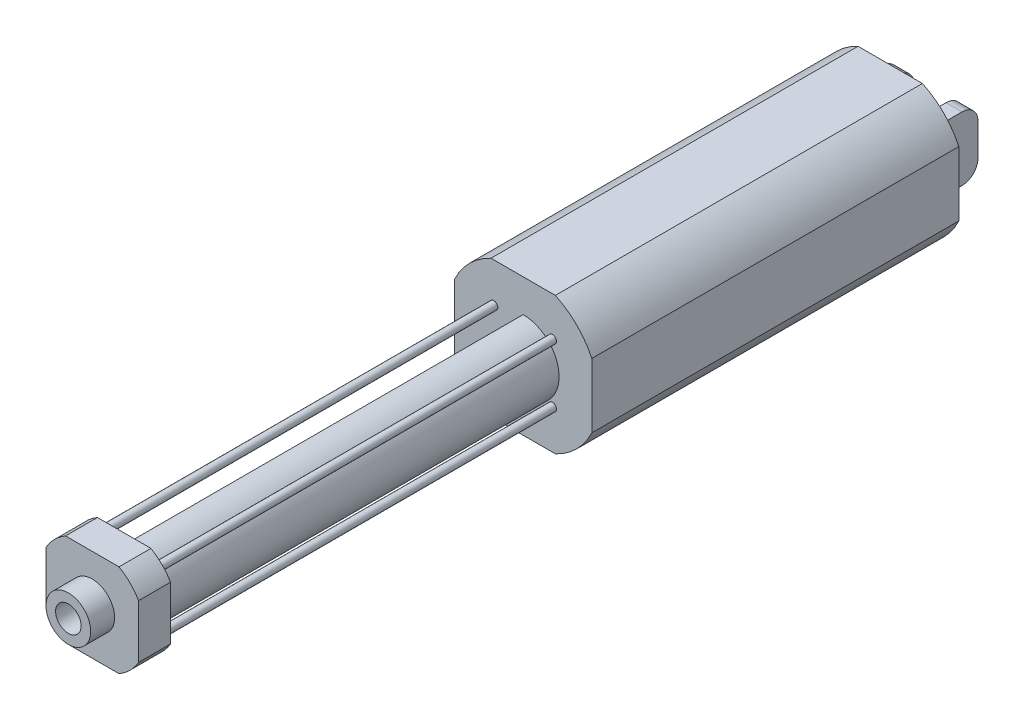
ISO-10303-21;
HEADER;
FILE_DESCRIPTION(('STEP AP214'),'2;1');
FILE_NAME('part.step','',(''),(''),'','','');
FILE_SCHEMA(('AUTOMOTIVE_DESIGN { 1 0 10303 214 1 1 1 1 }'));
ENDSEC;
DATA;
#1=APPLICATION_CONTEXT('core data for automotive mechanical design processes');
#2=APPLICATION_PROTOCOL_DEFINITION('international standard','automotive_design',2000,#1);
#3=PRODUCT_CONTEXT('',#1,'mechanical');
#4=PRODUCT('Part','Part','',(#3));
#5=PRODUCT_RELATED_PRODUCT_CATEGORY('part','',(#4));
#6=PRODUCT_DEFINITION_FORMATION('','',#4);
#7=PRODUCT_DEFINITION_CONTEXT('part definition',#1,'design');
#8=PRODUCT_DEFINITION('design','',#6,#7);
#9=PRODUCT_DEFINITION_SHAPE('','',#8);
#10=(LENGTH_UNIT() NAMED_UNIT(*) SI_UNIT(.MILLI.,.METRE.));
#11=(NAMED_UNIT(*) PLANE_ANGLE_UNIT() SI_UNIT($,.RADIAN.));
#12=(NAMED_UNIT(*) SI_UNIT($,.STERADIAN.) SOLID_ANGLE_UNIT());
#13=UNCERTAINTY_MEASURE_WITH_UNIT(LENGTH_MEASURE(1.E-05),#10,'distance_accuracy_value','');
#14=(GEOMETRIC_REPRESENTATION_CONTEXT(3) GLOBAL_UNCERTAINTY_ASSIGNED_CONTEXT((#13)) GLOBAL_UNIT_ASSIGNED_CONTEXT((#10,
#11,#12)) REPRESENTATION_CONTEXT('',''));
#15=CARTESIAN_POINT('',(0.,0.,0.));
#16=DIRECTION('',(0.,0.,1.));
#17=DIRECTION('',(1.,0.,0.));
#18=AXIS2_PLACEMENT_3D('',#15,#16,#17);
#19=CARTESIAN_POINT('',(43.,43.,500.));
#20=DIRECTION('',(0.,0.,1.));
#21=DIRECTION('',(1.,0.,0.));
#22=AXIS2_PLACEMENT_3D('',#19,#20,#21);
#23=PLANE('',#22);
#24=CARTESIAN_POINT('',(43.,43.,500.));
#25=DIRECTION('',(0.,0.,1.));
#26=DIRECTION('',(1.,0.,0.));
#27=AXIS2_PLACEMENT_3D('',#24,#25,#26);
#28=CIRCLE('',#27,33.5);
#29=CARTESIAN_POINT('',(59.7705098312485,14.,500.));
#30=VERTEX_POINT('',#29);
#31=CARTESIAN_POINT('',(72.,26.2294901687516,500.));
#32=VERTEX_POINT('',#31);
#33=EDGE_CURVE('E251',#30,#32,#28,.T.);
#34=ORIENTED_EDGE('',*,*,#33,.T.);
#35=DIRECTION('',(0.,1.,0.));
#36=VECTOR('',#35,1.);
#37=CARTESIAN_POINT('',(72.,26.2294901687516,500.));
#38=LINE('',#37,#36);
#39=CARTESIAN_POINT('',(72.,59.7705098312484,500.));
#40=VERTEX_POINT('',#39);
#41=EDGE_CURVE('E240',#32,#40,#38,.T.);
#42=ORIENTED_EDGE('',*,*,#41,.T.);
#43=CARTESIAN_POINT('',(43.,43.,500.));
#44=DIRECTION('',(0.,0.,1.));
#45=DIRECTION('',(1.,0.,0.));
#46=AXIS2_PLACEMENT_3D('',#43,#44,#45);
#47=CIRCLE('',#46,33.5);
#48=CARTESIAN_POINT('',(59.7705098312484,72.,500.));
#49=VERTEX_POINT('',#48);
#50=EDGE_CURVE('E250',#40,#49,#47,.T.);
#51=ORIENTED_EDGE('',*,*,#50,.T.);
#52=DIRECTION('',(-1.,0.,0.));
#53=VECTOR('',#52,1.);
#54=CARTESIAN_POINT('',(59.7705098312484,72.,500.));
#55=LINE('',#54,#53);
#56=CARTESIAN_POINT('',(26.2294901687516,72.,500.));
#57=VERTEX_POINT('',#56);
#58=EDGE_CURVE('E847',#49,#57,#55,.T.);
#59=ORIENTED_EDGE('',*,*,#58,.T.);
#60=CARTESIAN_POINT('',(43.,43.,500.));
#61=DIRECTION('',(0.,0.,1.));
#62=DIRECTION('',(1.,0.,0.));
#63=AXIS2_PLACEMENT_3D('',#60,#61,#62);
#64=CIRCLE('',#63,33.5);
#65=CARTESIAN_POINT('',(14.,59.7705098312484,500.));
#66=VERTEX_POINT('',#65);
#67=EDGE_CURVE('E849',#57,#66,#64,.T.);
#68=ORIENTED_EDGE('',*,*,#67,.T.);
#69=DIRECTION('',(0.,-1.,0.));
#70=VECTOR('',#69,1.);
#71=CARTESIAN_POINT('',(14.,59.7705098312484,500.));
#72=LINE('',#71,#70);
#73=CARTESIAN_POINT('',(14.,26.2294901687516,500.));
#74=VERTEX_POINT('',#73);
#75=EDGE_CURVE('E851',#66,#74,#72,.T.);
#76=ORIENTED_EDGE('',*,*,#75,.T.);
#77=CARTESIAN_POINT('',(43.,43.,500.));
#78=DIRECTION('',(0.,0.,1.));
#79=DIRECTION('',(1.,0.,0.));
#80=AXIS2_PLACEMENT_3D('',#77,#78,#79);
#81=CIRCLE('',#80,33.5);
#82=CARTESIAN_POINT('',(26.2294901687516,14.,500.));
#83=VERTEX_POINT('',#82);
#84=EDGE_CURVE('E853',#74,#83,#81,.T.);
#85=ORIENTED_EDGE('',*,*,#84,.T.);
#86=DIRECTION('',(1.,0.,0.));
#87=VECTOR('',#86,1.);
#88=CARTESIAN_POINT('',(26.2294901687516,14.,500.));
#89=LINE('',#88,#87);
#90=EDGE_CURVE('E256',#83,#30,#89,.T.);
#91=ORIENTED_EDGE('',*,*,#90,.T.);
#92=EDGE_LOOP('',(#34,#42,#51,#59,#68,#76,#85,#91));
#93=FACE_BOUND('',#92,.T.);
#94=CARTESIAN_POINT('',(43.,43.,500.));
#95=DIRECTION('',(0.,0.,1.));
#96=DIRECTION('',(1.,0.,0.));
#97=AXIS2_PLACEMENT_3D('',#94,#95,#96);
#98=CIRCLE('',#97,14.);
#99=CARTESIAN_POINT('',(57.,43.,500.));
#100=VERTEX_POINT('',#99);
#101=EDGE_CURVE('E826',#100,#100,#98,.T.);
#102=ORIENTED_EDGE('',*,*,#101,.F.);
#103=EDGE_LOOP('',(#102));
#104=FACE_BOUND('',#103,.T.);
#105=ADVANCED_FACE('F30',(#93,#104),#23,.T.);
#106=CARTESIAN_POINT('',(43.,43.,0.));
#107=DIRECTION('',(0.,0.,1.));
#108=DIRECTION('',(1.,0.,0.));
#109=AXIS2_PLACEMENT_3D('',#106,#107,#108);
#110=PLANE('',#109);
#111=DIRECTION('',(0.,-1.,0.));
#112=VECTOR('',#111,1.);
#113=CARTESIAN_POINT('',(68.,63.,0.));
#114=LINE('',#113,#112);
#115=CARTESIAN_POINT('',(68.,63.,0.));
#116=VERTEX_POINT('',#115);
#117=CARTESIAN_POINT('',(68.,23.,0.));
#118=VERTEX_POINT('',#117);
#119=EDGE_CURVE('E302',#116,#118,#114,.T.);
#120=ORIENTED_EDGE('',*,*,#119,.F.);
#121=DIRECTION('',(1.,0.,0.));
#122=VECTOR('',#121,1.);
#123=CARTESIAN_POINT('',(68.,63.,0.));
#124=LINE('',#123,#122);
#125=CARTESIAN_POINT('',(58.,63.,0.));
#126=VERTEX_POINT('',#125);
#127=EDGE_CURVE('E307',#126,#116,#124,.T.);
#128=ORIENTED_EDGE('',*,*,#127,.F.);
#129=DIRECTION('',(0.,1.,0.));
#130=VECTOR('',#129,1.);
#131=CARTESIAN_POINT('',(58.,63.,0.));
#132=LINE('',#131,#130);
#133=CARTESIAN_POINT('',(58.,23.,0.));
#134=VERTEX_POINT('',#133);
#135=EDGE_CURVE('E316',#134,#126,#132,.T.);
#136=ORIENTED_EDGE('',*,*,#135,.F.);
#137=DIRECTION('',(-1.,0.,0.));
#138=VECTOR('',#137,1.);
#139=CARTESIAN_POINT('',(68.,23.,0.));
#140=LINE('',#139,#138);
#141=EDGE_CURVE('E313',#118,#134,#140,.T.);
#142=ORIENTED_EDGE('',*,*,#141,.F.);
#143=EDGE_LOOP('',(#120,#128,#136,#142));
#144=FACE_BOUND('',#143,.T.);
#145=CARTESIAN_POINT('',(43.,43.,0.));
#146=DIRECTION('',(0.,0.,1.));
#147=DIRECTION('',(1.,0.,0.));
#148=AXIS2_PLACEMENT_3D('',#145,#146,#147);
#149=CIRCLE('',#148,47.5);
#150=CARTESIAN_POINT('',(22.8195639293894,86.,0.));
#151=VERTEX_POINT('',#150);
#152=CARTESIAN_POINT('',(0.,63.1804360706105,0.));
#153=VERTEX_POINT('',#152);
#154=EDGE_CURVE('E360',#151,#153,#149,.T.);
#155=ORIENTED_EDGE('',*,*,#154,.F.);
#156=DIRECTION('',(-1.,0.,0.));
#157=VECTOR('',#156,1.);
#158=CARTESIAN_POINT('',(22.8195639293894,86.,0.));
#159=LINE('',#158,#157);
#160=CARTESIAN_POINT('',(63.1804360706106,86.,0.));
#161=VERTEX_POINT('',#160);
#162=EDGE_CURVE('E365',#161,#151,#159,.T.);
#163=ORIENTED_EDGE('',*,*,#162,.F.);
#164=CARTESIAN_POINT('',(43.,43.,0.));
#165=DIRECTION('',(0.,0.,1.));
#166=DIRECTION('',(1.,0.,0.));
#167=AXIS2_PLACEMENT_3D('',#164,#165,#166);
#168=CIRCLE('',#167,47.5);
#169=CARTESIAN_POINT('',(86.,63.1804360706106,0.));
#170=VERTEX_POINT('',#169);
#171=EDGE_CURVE('E392',#170,#161,#168,.T.);
#172=ORIENTED_EDGE('',*,*,#171,.F.);
#173=DIRECTION('',(0.,1.,0.));
#174=VECTOR('',#173,1.);
#175=CARTESIAN_POINT('',(86.,63.1804360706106,0.));
#176=LINE('',#175,#174);
#177=CARTESIAN_POINT('',(86.,22.8195639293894,0.));
#178=VERTEX_POINT('',#177);
#179=EDGE_CURVE('E390',#178,#170,#176,.T.);
#180=ORIENTED_EDGE('',*,*,#179,.F.);
#181=CARTESIAN_POINT('',(43.,43.,0.));
#182=DIRECTION('',(0.,0.,1.));
#183=DIRECTION('',(1.,0.,0.));
#184=AXIS2_PLACEMENT_3D('',#181,#182,#183);
#185=CIRCLE('',#184,47.5);
#186=CARTESIAN_POINT('',(63.1804360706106,0.,0.));
#187=VERTEX_POINT('',#186);
#188=EDGE_CURVE('E388',#187,#178,#185,.T.);
#189=ORIENTED_EDGE('',*,*,#188,.F.);
#190=DIRECTION('',(1.,0.,0.));
#191=VECTOR('',#190,1.);
#192=CARTESIAN_POINT('',(22.8195639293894,0.,0.));
#193=LINE('',#192,#191);
#194=CARTESIAN_POINT('',(22.8195639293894,0.,0.));
#195=VERTEX_POINT('',#194);
#196=EDGE_CURVE('E386',#195,#187,#193,.T.);
#197=ORIENTED_EDGE('',*,*,#196,.F.);
#198=CARTESIAN_POINT('',(43.,43.,0.));
#199=DIRECTION('',(0.,0.,1.));
#200=DIRECTION('',(1.,0.,0.));
#201=AXIS2_PLACEMENT_3D('',#198,#199,#200);
#202=CIRCLE('',#201,47.5);
#203=CARTESIAN_POINT('',(0.,22.8195639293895,0.));
#204=VERTEX_POINT('',#203);
#205=EDGE_CURVE('E384',#204,#195,#202,.T.);
#206=ORIENTED_EDGE('',*,*,#205,.F.);
#207=DIRECTION('',(0.,-1.,0.));
#208=VECTOR('',#207,1.);
#209=CARTESIAN_POINT('',(0.,63.1804360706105,0.));
#210=LINE('',#209,#208);
#211=EDGE_CURVE('E382',#153,#204,#210,.T.);
#212=ORIENTED_EDGE('',*,*,#211,.F.);
#213=EDGE_LOOP('',(#155,#163,#172,#180,#189,#197,#206,#212));
#214=FACE_BOUND('',#213,.T.);
#215=DIRECTION('',(1.,0.,0.));
#216=VECTOR('',#215,1.);
#217=CARTESIAN_POINT('',(18.,63.,0.));
#218=LINE('',#217,#216);
#219=CARTESIAN_POINT('',(18.,63.,0.));
#220=VERTEX_POINT('',#219);
#221=CARTESIAN_POINT('',(28.,63.,0.));
#222=VERTEX_POINT('',#221);
#223=EDGE_CURVE('E276',#220,#222,#218,.T.);
#224=ORIENTED_EDGE('',*,*,#223,.F.);
#225=DIRECTION('',(0.,1.,0.));
#226=VECTOR('',#225,1.);
#227=CARTESIAN_POINT('',(18.,63.,0.));
#228=LINE('',#227,#226);
#229=CARTESIAN_POINT('',(18.,23.,0.));
#230=VERTEX_POINT('',#229);
#231=EDGE_CURVE('E281',#230,#220,#228,.T.);
#232=ORIENTED_EDGE('',*,*,#231,.F.);
#233=DIRECTION('',(-1.,0.,0.));
#234=VECTOR('',#233,1.);
#235=CARTESIAN_POINT('',(18.,23.,0.));
#236=LINE('',#235,#234);
#237=CARTESIAN_POINT('',(28.,23.,0.));
#238=VERTEX_POINT('',#237);
#239=EDGE_CURVE('E290',#238,#230,#236,.T.);
#240=ORIENTED_EDGE('',*,*,#239,.F.);
#241=DIRECTION('',(0.,-1.,0.));
#242=VECTOR('',#241,1.);
#243=CARTESIAN_POINT('',(28.,63.,0.));
#244=LINE('',#243,#242);
#245=EDGE_CURVE('E287',#222,#238,#244,.T.);
#246=ORIENTED_EDGE('',*,*,#245,.F.);
#247=EDGE_LOOP('',(#224,#232,#240,#246));
#248=FACE_BOUND('',#247,.T.);
#249=ADVANCED_FACE('F467',(#144,#214,#248),#110,.F.);
#250=CARTESIAN_POINT('',(43.,43.,230.));
#251=DIRECTION('',(0.,0.,1.));
#252=DIRECTION('',(1.,0.,0.));
#253=AXIS2_PLACEMENT_3D('',#250,#251,#252);
#254=PLANE('',#253);
#255=CARTESIAN_POINT('',(24.6152236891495,24.61522368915,230.));
#256=DIRECTION('',(0.,0.,1.));
#257=DIRECTION('',(1.,0.,0.));
#258=AXIS2_PLACEMENT_3D('',#255,#256,#257);
#259=CIRCLE('',#258,2.5);
#260=CARTESIAN_POINT('',(27.1152236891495,24.61522368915,230.));
#261=VERTEX_POINT('',#260);
#262=EDGE_CURVE('E11',#261,#261,#259,.T.);
#263=ORIENTED_EDGE('',*,*,#262,.F.);
#264=EDGE_LOOP('',(#263));
#265=FACE_BOUND('',#264,.T.);
#266=CARTESIAN_POINT('',(61.3847763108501,24.6152236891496,230.));
#267=DIRECTION('',(0.,0.,1.));
#268=DIRECTION('',(1.,0.,0.));
#269=AXIS2_PLACEMENT_3D('',#266,#267,#268);
#270=CIRCLE('',#269,2.5);
#271=CARTESIAN_POINT('',(63.8847763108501,24.6152236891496,230.));
#272=VERTEX_POINT('',#271);
#273=EDGE_CURVE('E38',#272,#272,#270,.T.);
#274=ORIENTED_EDGE('',*,*,#273,.F.);
#275=EDGE_LOOP('',(#274));
#276=FACE_BOUND('',#275,.T.);
#277=CARTESIAN_POINT('',(61.3847763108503,61.3847763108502,230.));
#278=DIRECTION('',(0.,0.,1.));
#279=DIRECTION('',(1.,0.,0.));
#280=AXIS2_PLACEMENT_3D('',#277,#278,#279);
#281=CIRCLE('',#280,2.5);
#282=CARTESIAN_POINT('',(63.8847763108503,61.3847763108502,230.));
#283=VERTEX_POINT('',#282);
#284=EDGE_CURVE('E455',#283,#283,#281,.T.);
#285=ORIENTED_EDGE('',*,*,#284,.F.);
#286=EDGE_LOOP('',(#285));
#287=FACE_BOUND('',#286,.T.);
#288=CARTESIAN_POINT('',(24.6152236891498,61.3847763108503,230.));
#289=DIRECTION('',(0.,0.,1.));
#290=DIRECTION('',(1.,0.,0.));
#291=AXIS2_PLACEMENT_3D('',#288,#289,#290);
#292=CIRCLE('',#291,2.5);
#293=CARTESIAN_POINT('',(27.1152236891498,61.3847763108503,230.));
#294=VERTEX_POINT('',#293);
#295=EDGE_CURVE('E452',#294,#294,#292,.T.);
#296=ORIENTED_EDGE('',*,*,#295,.F.);
#297=EDGE_LOOP('',(#296));
#298=FACE_BOUND('',#297,.T.);
#299=CARTESIAN_POINT('',(43.,43.,230.));
#300=DIRECTION('',(0.,0.,1.));
#301=DIRECTION('',(1.,0.,0.));
#302=AXIS2_PLACEMENT_3D('',#299,#300,#301);
#303=CIRCLE('',#302,47.5);
#304=CARTESIAN_POINT('',(22.8195639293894,86.,230.));
#305=VERTEX_POINT('',#304);
#306=CARTESIAN_POINT('',(0.,63.1804360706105,230.));
#307=VERTEX_POINT('',#306);
#308=EDGE_CURVE('E361',#305,#307,#303,.T.);
#309=ORIENTED_EDGE('',*,*,#308,.T.);
#310=DIRECTION('',(0.,-1.,0.));
#311=VECTOR('',#310,1.);
#312=CARTESIAN_POINT('',(0.,63.1804360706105,230.));
#313=LINE('',#312,#311);
#314=CARTESIAN_POINT('',(0.,22.8195639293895,230.));
#315=VERTEX_POINT('',#314);
#316=EDGE_CURVE('E364',#307,#315,#313,.T.);
#317=ORIENTED_EDGE('',*,*,#316,.T.);
#318=CARTESIAN_POINT('',(43.,43.,230.));
#319=DIRECTION('',(0.,0.,1.));
#320=DIRECTION('',(1.,0.,0.));
#321=AXIS2_PLACEMENT_3D('',#318,#319,#320);
#322=CIRCLE('',#321,47.5);
#323=CARTESIAN_POINT('',(22.8195639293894,0.,230.));
#324=VERTEX_POINT('',#323);
#325=EDGE_CURVE('E367',#315,#324,#322,.T.);
#326=ORIENTED_EDGE('',*,*,#325,.T.);
#327=DIRECTION('',(1.,0.,0.));
#328=VECTOR('',#327,1.);
#329=CARTESIAN_POINT('',(22.8195639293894,0.,230.));
#330=LINE('',#329,#328);
#331=CARTESIAN_POINT('',(63.1804360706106,0.,230.));
#332=VERTEX_POINT('',#331);
#333=EDGE_CURVE('E369',#324,#332,#330,.T.);
#334=ORIENTED_EDGE('',*,*,#333,.T.);
#335=CARTESIAN_POINT('',(43.,43.,230.));
#336=DIRECTION('',(0.,0.,1.));
#337=DIRECTION('',(1.,0.,0.));
#338=AXIS2_PLACEMENT_3D('',#335,#336,#337);
#339=CIRCLE('',#338,47.5);
#340=CARTESIAN_POINT('',(86.,22.8195639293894,230.));
#341=VERTEX_POINT('',#340);
#342=EDGE_CURVE('E371',#332,#341,#339,.T.);
#343=ORIENTED_EDGE('',*,*,#342,.T.);
#344=DIRECTION('',(0.,1.,0.));
#345=VECTOR('',#344,1.);
#346=CARTESIAN_POINT('',(86.,63.1804360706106,230.));
#347=LINE('',#346,#345);
#348=CARTESIAN_POINT('',(86.,63.1804360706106,230.));
#349=VERTEX_POINT('',#348);
#350=EDGE_CURVE('E373',#341,#349,#347,.T.);
#351=ORIENTED_EDGE('',*,*,#350,.T.);
#352=CARTESIAN_POINT('',(43.,43.,230.));
#353=DIRECTION('',(0.,0.,1.));
#354=DIRECTION('',(1.,0.,0.));
#355=AXIS2_PLACEMENT_3D('',#352,#353,#354);
#356=CIRCLE('',#355,47.5);
#357=CARTESIAN_POINT('',(63.1804360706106,86.,230.));
#358=VERTEX_POINT('',#357);
#359=EDGE_CURVE('E375',#349,#358,#356,.T.);
#360=ORIENTED_EDGE('',*,*,#359,.T.);
#361=DIRECTION('',(-1.,0.,0.));
#362=VECTOR('',#361,1.);
#363=CARTESIAN_POINT('',(22.8195639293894,86.,230.));
#364=LINE('',#363,#362);
#365=EDGE_CURVE('E377',#358,#305,#364,.T.);
#366=ORIENTED_EDGE('',*,*,#365,.T.);
#367=EDGE_LOOP('',(#309,#317,#326,#334,#343,#351,#360,#366));
#368=FACE_BOUND('',#367,.T.);
#369=DIRECTION('',(0.,-1.,0.));
#370=VECTOR('',#369,1.);
#371=CARTESIAN_POINT('',(43.,65.5,230.));
#372=LINE('',#371,#370);
#373=CARTESIAN_POINT('',(43.,65.5,230.));
#374=VERTEX_POINT('',#373);
#375=CARTESIAN_POINT('',(43.,63.,230.));
#376=VERTEX_POINT('',#375);
#377=EDGE_CURVE('E345',#374,#376,#372,.T.);
#378=ORIENTED_EDGE('',*,*,#377,.F.);
#379=CARTESIAN_POINT('',(43.,43.,230.));
#380=DIRECTION('',(0.,0.,1.));
#381=DIRECTION('',(1.,0.,0.));
#382=AXIS2_PLACEMENT_3D('',#379,#380,#381);
#383=CIRCLE('',#382,22.5);
#384=CARTESIAN_POINT('',(20.5,43.,230.));
#385=VERTEX_POINT('',#384);
#386=EDGE_CURVE('E328',#385,#374,#383,.T.);
#387=ORIENTED_EDGE('',*,*,#386,.F.);
#388=DIRECTION('',(-1.,0.,0.));
#389=VECTOR('',#388,1.);
#390=CARTESIAN_POINT('',(20.5,43.,230.));
#391=LINE('',#390,#389);
#392=CARTESIAN_POINT('',(23.,43.,230.));
#393=VERTEX_POINT('',#392);
#394=EDGE_CURVE('E333',#393,#385,#391,.T.);
#395=ORIENTED_EDGE('',*,*,#394,.F.);
#396=CARTESIAN_POINT('',(43.,43.,230.));
#397=DIRECTION('',(0.,0.,-1.));
#398=DIRECTION('',(1.,0.,0.));
#399=AXIS2_PLACEMENT_3D('',#396,#397,#398);
#400=CIRCLE('',#399,20.);
#401=EDGE_CURVE('E347',#376,#393,#400,.T.);
#402=ORIENTED_EDGE('',*,*,#401,.F.);
#403=EDGE_LOOP('',(#378,#387,#395,#402));
#404=FACE_BOUND('',#403,.T.);
#405=ADVANCED_FACE('F463',(#265,#276,#287,#298,#368,#404),#254,.T.);
#406=CARTESIAN_POINT('',(43.,43.,230.));
#407=DIRECTION('',(0.,0.,-1.));
#408=DIRECTION('',(-1.,0.,0.));
#409=AXIS2_PLACEMENT_3D('',#406,#407,#408);
#410=CYLINDRICAL_SURFACE('',#409,47.5);
#411=ORIENTED_EDGE('',*,*,#154,.T.);
#412=DIRECTION('',(0.,0.,-1.));
#413=VECTOR('',#412,1.);
#414=CARTESIAN_POINT('',(0.,63.1804360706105,230.));
#415=LINE('',#414,#413);
#416=EDGE_CURVE('E415',#307,#153,#415,.T.);
#417=ORIENTED_EDGE('',*,*,#416,.F.);
#418=ORIENTED_EDGE('',*,*,#308,.F.);
#419=DIRECTION('',(0.,0.,-1.));
#420=VECTOR('',#419,1.);
#421=CARTESIAN_POINT('',(22.8195639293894,86.,230.));
#422=LINE('',#421,#420);
#423=EDGE_CURVE('E379',#305,#151,#422,.T.);
#424=ORIENTED_EDGE('',*,*,#423,.T.);
#425=EDGE_LOOP('',(#411,#417,#418,#424));
#426=FACE_BOUND('',#425,.T.);
#427=ADVANCED_FACE('F466',(#426),#410,.T.);
#428=CARTESIAN_POINT('',(0.,63.1804360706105,230.));
#429=DIRECTION('',(1.,0.,0.));
#430=DIRECTION('',(0.,0.,-1.));
#431=AXIS2_PLACEMENT_3D('',#428,#429,#430);
#432=PLANE('',#431);
#433=ORIENTED_EDGE('',*,*,#211,.T.);
#434=DIRECTION('',(0.,0.,-1.));
#435=VECTOR('',#434,1.);
#436=CARTESIAN_POINT('',(0.,22.8195639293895,230.));
#437=LINE('',#436,#435);
#438=EDGE_CURVE('E412',#315,#204,#437,.T.);
#439=ORIENTED_EDGE('',*,*,#438,.F.);
#440=ORIENTED_EDGE('',*,*,#316,.F.);
#441=ORIENTED_EDGE('',*,*,#416,.T.);
#442=EDGE_LOOP('',(#433,#439,#440,#441));
#443=FACE_BOUND('',#442,.T.);
#444=ADVANCED_FACE('F637',(#443),#432,.F.);
#445=CARTESIAN_POINT('',(43.,43.,230.));
#446=DIRECTION('',(0.,0.,-1.));
#447=DIRECTION('',(-1.,0.,0.));
#448=AXIS2_PLACEMENT_3D('',#445,#446,#447);
#449=CYLINDRICAL_SURFACE('',#448,47.5);
#450=ORIENTED_EDGE('',*,*,#205,.T.);
#451=DIRECTION('',(0.,0.,-1.));
#452=VECTOR('',#451,1.);
#453=CARTESIAN_POINT('',(22.8195639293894,0.,230.));
#454=LINE('',#453,#452);
#455=EDGE_CURVE('E409',#324,#195,#454,.T.);
#456=ORIENTED_EDGE('',*,*,#455,.F.);
#457=ORIENTED_EDGE('',*,*,#325,.F.);
#458=ORIENTED_EDGE('',*,*,#438,.T.);
#459=EDGE_LOOP('',(#450,#456,#457,#458));
#460=FACE_BOUND('',#459,.T.);
#461=ADVANCED_FACE('F641',(#460),#449,.T.);
#462=CARTESIAN_POINT('',(22.8195639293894,0.,230.));
#463=DIRECTION('',(0.,1.,0.));
#464=DIRECTION('',(0.,0.,1.));
#465=AXIS2_PLACEMENT_3D('',#462,#463,#464);
#466=PLANE('',#465);
#467=ORIENTED_EDGE('',*,*,#196,.T.);
#468=DIRECTION('',(0.,0.,-1.));
#469=VECTOR('',#468,1.);
#470=CARTESIAN_POINT('',(63.1804360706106,0.,230.));
#471=LINE('',#470,#469);
#472=EDGE_CURVE('E406',#332,#187,#471,.T.);
#473=ORIENTED_EDGE('',*,*,#472,.F.);
#474=ORIENTED_EDGE('',*,*,#333,.F.);
#475=ORIENTED_EDGE('',*,*,#455,.T.);
#476=EDGE_LOOP('',(#467,#473,#474,#475));
#477=FACE_BOUND('',#476,.T.);
#478=ADVANCED_FACE('F645',(#477),#466,.F.);
#479=CARTESIAN_POINT('',(43.,43.,230.));
#480=DIRECTION('',(0.,0.,-1.));
#481=DIRECTION('',(-1.,0.,0.));
#482=AXIS2_PLACEMENT_3D('',#479,#480,#481);
#483=CYLINDRICAL_SURFACE('',#482,47.5);
#484=ORIENTED_EDGE('',*,*,#188,.T.);
#485=DIRECTION('',(0.,0.,-1.));
#486=VECTOR('',#485,1.);
#487=CARTESIAN_POINT('',(86.,22.8195639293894,230.));
#488=LINE('',#487,#486);
#489=EDGE_CURVE('E403',#341,#178,#488,.T.);
#490=ORIENTED_EDGE('',*,*,#489,.F.);
#491=ORIENTED_EDGE('',*,*,#342,.F.);
#492=ORIENTED_EDGE('',*,*,#472,.T.);
#493=EDGE_LOOP('',(#484,#490,#491,#492));
#494=FACE_BOUND('',#493,.T.);
#495=ADVANCED_FACE('F649',(#494),#483,.T.);
#496=CARTESIAN_POINT('',(86.,63.1804360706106,230.));
#497=DIRECTION('',(-1.,0.,0.));
#498=DIRECTION('',(0.,-1.,0.));
#499=AXIS2_PLACEMENT_3D('',#496,#497,#498);
#500=PLANE('',#499);
#501=ORIENTED_EDGE('',*,*,#179,.T.);
#502=DIRECTION('',(0.,0.,-1.));
#503=VECTOR('',#502,1.);
#504=CARTESIAN_POINT('',(86.,63.1804360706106,230.));
#505=LINE('',#504,#503);
#506=EDGE_CURVE('E400',#349,#170,#505,.T.);
#507=ORIENTED_EDGE('',*,*,#506,.F.);
#508=ORIENTED_EDGE('',*,*,#350,.F.);
#509=ORIENTED_EDGE('',*,*,#489,.T.);
#510=EDGE_LOOP('',(#501,#507,#508,#509));
#511=FACE_BOUND('',#510,.T.);
#512=ADVANCED_FACE('F653',(#511),#500,.F.);
#513=CARTESIAN_POINT('',(43.,43.,230.));
#514=DIRECTION('',(0.,0.,-1.));
#515=DIRECTION('',(-1.,0.,0.));
#516=AXIS2_PLACEMENT_3D('',#513,#514,#515);
#517=CYLINDRICAL_SURFACE('',#516,47.5);
#518=ORIENTED_EDGE('',*,*,#171,.T.);
#519=DIRECTION('',(0.,0.,-1.));
#520=VECTOR('',#519,1.);
#521=CARTESIAN_POINT('',(63.1804360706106,86.,230.));
#522=LINE('',#521,#520);
#523=EDGE_CURVE('E397',#358,#161,#522,.T.);
#524=ORIENTED_EDGE('',*,*,#523,.F.);
#525=ORIENTED_EDGE('',*,*,#359,.F.);
#526=ORIENTED_EDGE('',*,*,#506,.T.);
#527=EDGE_LOOP('',(#518,#524,#525,#526));
#528=FACE_BOUND('',#527,.T.);
#529=ADVANCED_FACE('F657',(#528),#517,.T.);
#530=CARTESIAN_POINT('',(22.8195639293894,86.,230.));
#531=DIRECTION('',(0.,-1.,0.));
#532=DIRECTION('',(0.,0.,-1.));
#533=AXIS2_PLACEMENT_3D('',#530,#531,#532);
#534=PLANE('',#533);
#535=ORIENTED_EDGE('',*,*,#162,.T.);
#536=ORIENTED_EDGE('',*,*,#423,.F.);
#537=ORIENTED_EDGE('',*,*,#365,.F.);
#538=ORIENTED_EDGE('',*,*,#523,.T.);
#539=EDGE_LOOP('',(#535,#536,#537,#538));
#540=FACE_BOUND('',#539,.T.);
#541=ADVANCED_FACE('F661',(#540),#534,.F.);
#542=CARTESIAN_POINT('',(43.,43.,480.));
#543=DIRECTION('',(0.,0.,-1.));
#544=DIRECTION('',(-1.,0.,0.));
#545=AXIS2_PLACEMENT_3D('',#542,#543,#544);
#546=CYLINDRICAL_SURFACE('',#545,22.5);
#547=ORIENTED_EDGE('',*,*,#386,.T.);
#548=DIRECTION('',(0.,0.,-1.));
#549=VECTOR('',#548,1.);
#550=CARTESIAN_POINT('',(43.,65.5,480.));
#551=LINE('',#550,#549);
#552=CARTESIAN_POINT('',(43.,65.5,480.));
#553=VERTEX_POINT('',#552);
#554=EDGE_CURVE('E358',#553,#374,#551,.T.);
#555=ORIENTED_EDGE('',*,*,#554,.F.);
#556=CARTESIAN_POINT('',(43.,43.,480.));
#557=DIRECTION('',(0.,0.,1.));
#558=DIRECTION('',(1.,0.,0.));
#559=AXIS2_PLACEMENT_3D('',#556,#557,#558);
#560=CIRCLE('',#559,22.5);
#561=CARTESIAN_POINT('',(20.5,43.,480.));
#562=VERTEX_POINT('',#561);
#563=EDGE_CURVE('E329',#562,#553,#560,.T.);
#564=ORIENTED_EDGE('',*,*,#563,.F.);
#565=DIRECTION('',(0.,0.,-1.));
#566=VECTOR('',#565,1.);
#567=CARTESIAN_POINT('',(20.5,43.,480.));
#568=LINE('',#567,#566);
#569=EDGE_CURVE('E342',#562,#385,#568,.T.);
#570=ORIENTED_EDGE('',*,*,#569,.T.);
#571=EDGE_LOOP('',(#547,#555,#564,#570));
#572=FACE_BOUND('',#571,.T.);
#573=ADVANCED_FACE('F491',(#572),#546,.T.);
#574=CARTESIAN_POINT('',(43.,65.5,480.));
#575=DIRECTION('',(1.,0.,0.));
#576=DIRECTION('',(0.,0.,-1.));
#577=AXIS2_PLACEMENT_3D('',#574,#575,#576);
#578=PLANE('',#577);
#579=ORIENTED_EDGE('',*,*,#377,.T.);
#580=DIRECTION('',(0.,0.,-1.));
#581=VECTOR('',#580,1.);
#582=CARTESIAN_POINT('',(43.,63.,480.));
#583=LINE('',#582,#581);
#584=CARTESIAN_POINT('',(43.,63.,480.));
#585=VERTEX_POINT('',#584);
#586=EDGE_CURVE('E355',#585,#376,#583,.T.);
#587=ORIENTED_EDGE('',*,*,#586,.F.);
#588=DIRECTION('',(0.,-1.,0.));
#589=VECTOR('',#588,1.);
#590=CARTESIAN_POINT('',(43.,65.5,480.));
#591=LINE('',#590,#589);
#592=EDGE_CURVE('E332',#553,#585,#591,.T.);
#593=ORIENTED_EDGE('',*,*,#592,.F.);
#594=ORIENTED_EDGE('',*,*,#554,.T.);
#595=EDGE_LOOP('',(#579,#587,#593,#594));
#596=FACE_BOUND('',#595,.T.);
#597=ADVANCED_FACE('F482',(#596),#578,.F.);
#598=CARTESIAN_POINT('',(43.,43.,480.));
#599=DIRECTION('',(0.,0.,-1.));
#600=DIRECTION('',(-1.,0.,0.));
#601=AXIS2_PLACEMENT_3D('',#598,#599,#600);
#602=CYLINDRICAL_SURFACE('',#601,20.);
#603=ORIENTED_EDGE('',*,*,#401,.T.);
#604=DIRECTION('',(0.,0.,-1.));
#605=VECTOR('',#604,1.);
#606=CARTESIAN_POINT('',(23.,43.,480.));
#607=LINE('',#606,#605);
#608=CARTESIAN_POINT('',(23.,43.,480.));
#609=VERTEX_POINT('',#608);
#610=EDGE_CURVE('E353',#609,#393,#607,.T.);
#611=ORIENTED_EDGE('',*,*,#610,.F.);
#612=CARTESIAN_POINT('',(43.,43.,480.));
#613=DIRECTION('',(0.,0.,-1.));
#614=DIRECTION('',(1.,0.,0.));
#615=AXIS2_PLACEMENT_3D('',#612,#613,#614);
#616=CIRCLE('',#615,20.);
#617=EDGE_CURVE('E336',#585,#609,#616,.T.);
#618=ORIENTED_EDGE('',*,*,#617,.F.);
#619=ORIENTED_EDGE('',*,*,#586,.T.);
#620=EDGE_LOOP('',(#603,#611,#618,#619));
#621=FACE_BOUND('',#620,.T.);
#622=ADVANCED_FACE('F486',(#621),#602,.F.);
#623=CARTESIAN_POINT('',(20.5,43.,480.));
#624=DIRECTION('',(0.,-1.,0.));
#625=DIRECTION('',(0.,0.,-1.));
#626=AXIS2_PLACEMENT_3D('',#623,#624,#625);
#627=PLANE('',#626);
#628=ORIENTED_EDGE('',*,*,#394,.T.);
#629=ORIENTED_EDGE('',*,*,#569,.F.);
#630=DIRECTION('',(-1.,0.,0.));
#631=VECTOR('',#630,1.);
#632=CARTESIAN_POINT('',(20.5,43.,480.));
#633=LINE('',#632,#631);
#634=EDGE_CURVE('E339',#609,#562,#633,.T.);
#635=ORIENTED_EDGE('',*,*,#634,.F.);
#636=ORIENTED_EDGE('',*,*,#610,.T.);
#637=EDGE_LOOP('',(#628,#629,#635,#636));
#638=FACE_BOUND('',#637,.T.);
#639=ADVANCED_FACE('F494',(#638),#627,.F.);
#640=CARTESIAN_POINT('',(68.,63.,-30.));
#641=DIRECTION('',(-1.,0.,0.));
#642=DIRECTION('',(0.,-1.,0.));
#643=AXIS2_PLACEMENT_3D('',#640,#641,#642);
#644=PLANE('',#643);
#645=DIRECTION('',(0.,0.,1.));
#646=VECTOR('',#645,1.);
#647=CARTESIAN_POINT('',(68.,23.,-30.));
#648=LINE('',#647,#646);
#649=CARTESIAN_POINT('',(68.,23.,-20.));
#650=VERTEX_POINT('',#649);
#651=EDGE_CURVE('E326',#650,#118,#648,.T.);
#652=ORIENTED_EDGE('',*,*,#651,.F.);
#653=CARTESIAN_POINT('',(68.,33.,-20.));
#654=DIRECTION('',(-1.,0.,0.));
#655=DIRECTION('',(0.,-1.,0.));
#656=AXIS2_PLACEMENT_3D('',#653,#654,#655);
#657=CIRCLE('',#656,10.);
#658=CARTESIAN_POINT('',(68.,33.,-30.));
#659=VERTEX_POINT('',#658);
#660=EDGE_CURVE('E432',#650,#659,#657,.F.);
#661=ORIENTED_EDGE('',*,*,#660,.T.);
#662=DIRECTION('',(0.,-1.,0.));
#663=VECTOR('',#662,1.);
#664=CARTESIAN_POINT('',(68.,63.,-30.));
#665=LINE('',#664,#663);
#666=CARTESIAN_POINT('',(68.,53.,-30.));
#667=VERTEX_POINT('',#666);
#668=EDGE_CURVE('E303',#667,#659,#665,.T.);
#669=ORIENTED_EDGE('',*,*,#668,.F.);
#670=CARTESIAN_POINT('',(68.,53.,-20.));
#671=DIRECTION('',(-1.,0.,0.));
#672=DIRECTION('',(0.,-1.,0.));
#673=AXIS2_PLACEMENT_3D('',#670,#671,#672);
#674=CIRCLE('',#673,10.);
#675=CARTESIAN_POINT('',(68.,63.,-20.));
#676=VERTEX_POINT('',#675);
#677=EDGE_CURVE('E430',#667,#676,#674,.F.);
#678=ORIENTED_EDGE('',*,*,#677,.T.);
#679=DIRECTION('',(0.,0.,1.));
#680=VECTOR('',#679,1.);
#681=CARTESIAN_POINT('',(68.,63.,-30.));
#682=LINE('',#681,#680);
#683=EDGE_CURVE('E310',#676,#116,#682,.T.);
#684=ORIENTED_EDGE('',*,*,#683,.T.);
#685=ORIENTED_EDGE('',*,*,#119,.T.);
#686=EDGE_LOOP('',(#652,#661,#669,#678,#684,#685));
#687=FACE_BOUND('',#686,.T.);
#688=ADVANCED_FACE('F496',(#687),#644,.F.);
#689=CARTESIAN_POINT('',(68.,23.,-30.));
#690=DIRECTION('',(0.,1.,0.));
#691=DIRECTION('',(0.,0.,1.));
#692=AXIS2_PLACEMENT_3D('',#689,#690,#691);
#693=PLANE('',#692);
#694=DIRECTION('',(0.,0.,1.));
#695=VECTOR('',#694,1.);
#696=CARTESIAN_POINT('',(58.,23.,-30.));
#697=LINE('',#696,#695);
#698=CARTESIAN_POINT('',(58.,23.,-20.));
#699=VERTEX_POINT('',#698);
#700=EDGE_CURVE('E324',#699,#134,#697,.T.);
#701=ORIENTED_EDGE('',*,*,#700,.F.);
#702=DIRECTION('',(-1.,0.,0.));
#703=VECTOR('',#702,1.);
#704=CARTESIAN_POINT('',(68.,23.,-20.));
#705=LINE('',#704,#703);
#706=EDGE_CURVE('E428',#699,#650,#705,.F.);
#707=ORIENTED_EDGE('',*,*,#706,.T.);
#708=ORIENTED_EDGE('',*,*,#651,.T.);
#709=ORIENTED_EDGE('',*,*,#141,.T.);
#710=EDGE_LOOP('',(#701,#707,#708,#709));
#711=FACE_BOUND('',#710,.T.);
#712=ADVANCED_FACE('F502',(#711),#693,.F.);
#713=CARTESIAN_POINT('',(58.,63.,-30.));
#714=DIRECTION('',(1.,0.,0.));
#715=DIRECTION('',(0.,1.,0.));
#716=AXIS2_PLACEMENT_3D('',#713,#714,#715);
#717=PLANE('',#716);
#718=CARTESIAN_POINT('',(58.,43.,-15.));
#719=DIRECTION('',(1.,0.,0.));
#720=DIRECTION('',(0.,1.,0.));
#721=AXIS2_PLACEMENT_3D('',#718,#719,#720);
#722=CIRCLE('',#721,6.);
#723=CARTESIAN_POINT('',(58.,49.,-15.));
#724=VERTEX_POINT('',#723);
#725=EDGE_CURVE('E268',#724,#724,#722,.T.);
#726=ORIENTED_EDGE('',*,*,#725,.T.);
#727=EDGE_LOOP('',(#726));
#728=FACE_BOUND('',#727,.T.);
#729=DIRECTION('',(0.,1.,0.));
#730=VECTOR('',#729,1.);
#731=CARTESIAN_POINT('',(58.,63.,-30.));
#732=LINE('',#731,#730);
#733=CARTESIAN_POINT('',(58.,33.,-30.));
#734=VERTEX_POINT('',#733);
#735=CARTESIAN_POINT('',(58.,53.,-30.));
#736=VERTEX_POINT('',#735);
#737=EDGE_CURVE('E306',#734,#736,#732,.T.);
#738=ORIENTED_EDGE('',*,*,#737,.F.);
#739=CARTESIAN_POINT('',(58.,33.,-20.));
#740=DIRECTION('',(1.,0.,0.));
#741=DIRECTION('',(0.,1.,0.));
#742=AXIS2_PLACEMENT_3D('',#739,#740,#741);
#743=CIRCLE('',#742,10.);
#744=EDGE_CURVE('E426',#734,#699,#743,.F.);
#745=ORIENTED_EDGE('',*,*,#744,.T.);
#746=ORIENTED_EDGE('',*,*,#700,.T.);
#747=ORIENTED_EDGE('',*,*,#135,.T.);
#748=DIRECTION('',(0.,0.,1.));
#749=VECTOR('',#748,1.);
#750=CARTESIAN_POINT('',(58.,63.,-30.));
#751=LINE('',#750,#749);
#752=CARTESIAN_POINT('',(58.,63.,-20.));
#753=VERTEX_POINT('',#752);
#754=EDGE_CURVE('E322',#753,#126,#751,.T.);
#755=ORIENTED_EDGE('',*,*,#754,.F.);
#756=CARTESIAN_POINT('',(58.,53.,-20.));
#757=DIRECTION('',(1.,0.,0.));
#758=DIRECTION('',(0.,1.,0.));
#759=AXIS2_PLACEMENT_3D('',#756,#757,#758);
#760=CIRCLE('',#759,10.);
#761=EDGE_CURVE('E424',#753,#736,#760,.F.);
#762=ORIENTED_EDGE('',*,*,#761,.T.);
#763=EDGE_LOOP('',(#738,#745,#746,#747,#755,#762));
#764=FACE_BOUND('',#763,.T.);
#765=ADVANCED_FACE('F578',(#728,#764),#717,.F.);
#766=CARTESIAN_POINT('',(68.,63.,-30.));
#767=DIRECTION('',(0.,-1.,0.));
#768=DIRECTION('',(1.,0.,0.));
#769=AXIS2_PLACEMENT_3D('',#766,#767,#768);
#770=PLANE('',#769);
#771=ORIENTED_EDGE('',*,*,#683,.F.);
#772=DIRECTION('',(1.,0.,0.));
#773=VECTOR('',#772,1.);
#774=CARTESIAN_POINT('',(58.,63.,-20.));
#775=LINE('',#774,#773);
#776=EDGE_CURVE('E434',#676,#753,#775,.F.);
#777=ORIENTED_EDGE('',*,*,#776,.T.);
#778=ORIENTED_EDGE('',*,*,#754,.T.);
#779=ORIENTED_EDGE('',*,*,#127,.T.);
#780=EDGE_LOOP('',(#771,#777,#778,#779));
#781=FACE_BOUND('',#780,.T.);
#782=ADVANCED_FACE('F574',(#781),#770,.F.);
#783=CARTESIAN_POINT('',(68.,23.,-30.));
#784=DIRECTION('',(0.,0.,-1.));
#785=DIRECTION('',(-1.,0.,0.));
#786=AXIS2_PLACEMENT_3D('',#783,#784,#785);
#787=PLANE('',#786);
#788=ORIENTED_EDGE('',*,*,#668,.T.);
#789=DIRECTION('',(-1.,0.,0.));
#790=VECTOR('',#789,1.);
#791=CARTESIAN_POINT('',(58.,33.,-30.));
#792=LINE('',#791,#790);
#793=EDGE_CURVE('E421',#659,#734,#792,.T.);
#794=ORIENTED_EDGE('',*,*,#793,.T.);
#795=ORIENTED_EDGE('',*,*,#737,.T.);
#796=DIRECTION('',(1.,0.,0.));
#797=VECTOR('',#796,1.);
#798=CARTESIAN_POINT('',(68.,53.,-30.));
#799=LINE('',#798,#797);
#800=EDGE_CURVE('E418',#736,#667,#799,.T.);
#801=ORIENTED_EDGE('',*,*,#800,.T.);
#802=EDGE_LOOP('',(#788,#794,#795,#801));
#803=FACE_BOUND('',#802,.T.);
#804=ADVANCED_FACE('F571',(#803),#787,.T.);
#805=CARTESIAN_POINT('',(18.,63.,-30.));
#806=DIRECTION('',(0.,-1.,0.));
#807=DIRECTION('',(0.,0.,-1.));
#808=AXIS2_PLACEMENT_3D('',#805,#806,#807);
#809=PLANE('',#808);
#810=DIRECTION('',(0.,0.,1.));
#811=VECTOR('',#810,1.);
#812=CARTESIAN_POINT('',(28.,63.,-30.));
#813=LINE('',#812,#811);
#814=CARTESIAN_POINT('',(28.,63.,-20.));
#815=VERTEX_POINT('',#814);
#816=EDGE_CURVE('E300',#815,#222,#813,.T.);
#817=ORIENTED_EDGE('',*,*,#816,.F.);
#818=DIRECTION('',(1.,0.,0.));
#819=VECTOR('',#818,1.);
#820=CARTESIAN_POINT('',(18.,63.,-20.));
#821=LINE('',#820,#819);
#822=CARTESIAN_POINT('',(18.,63.,-20.));
#823=VERTEX_POINT('',#822);
#824=EDGE_CURVE('E53',#815,#823,#821,.F.);
#825=ORIENTED_EDGE('',*,*,#824,.T.);
#826=DIRECTION('',(0.,0.,1.));
#827=VECTOR('',#826,1.);
#828=CARTESIAN_POINT('',(18.,63.,-30.));
#829=LINE('',#828,#827);
#830=EDGE_CURVE('E284',#823,#220,#829,.T.);
#831=ORIENTED_EDGE('',*,*,#830,.T.);
#832=ORIENTED_EDGE('',*,*,#223,.T.);
#833=EDGE_LOOP('',(#817,#825,#831,#832));
#834=FACE_BOUND('',#833,.T.);
#835=ADVANCED_FACE('F567',(#834),#809,.F.);
#836=CARTESIAN_POINT('',(28.,63.,-30.));
#837=DIRECTION('',(-1.,0.,0.));
#838=DIRECTION('',(0.,-1.,0.));
#839=AXIS2_PLACEMENT_3D('',#836,#837,#838);
#840=PLANE('',#839);
#841=CARTESIAN_POINT('',(28.,43.,-15.));
#842=DIRECTION('',(-1.,0.,0.));
#843=DIRECTION('',(0.,-1.,0.));
#844=AXIS2_PLACEMENT_3D('',#841,#842,#843);
#845=CIRCLE('',#844,6.);
#846=CARTESIAN_POINT('',(28.,37.,-15.));
#847=VERTEX_POINT('',#846);
#848=EDGE_CURVE('E265',#847,#847,#845,.T.);
#849=ORIENTED_EDGE('',*,*,#848,.T.);
#850=EDGE_LOOP('',(#849));
#851=FACE_BOUND('',#850,.T.);
#852=DIRECTION('',(0.,-1.,0.));
#853=VECTOR('',#852,1.);
#854=CARTESIAN_POINT('',(28.,63.,-30.));
#855=LINE('',#854,#853);
#856=CARTESIAN_POINT('',(28.,53.,-30.));
#857=VERTEX_POINT('',#856);
#858=CARTESIAN_POINT('',(28.,33.,-30.));
#859=VERTEX_POINT('',#858);
#860=EDGE_CURVE('E277',#857,#859,#855,.T.);
#861=ORIENTED_EDGE('',*,*,#860,.F.);
#862=CARTESIAN_POINT('',(28.,53.,-20.));
#863=DIRECTION('',(-1.,0.,0.));
#864=DIRECTION('',(0.,-1.,0.));
#865=AXIS2_PLACEMENT_3D('',#862,#863,#864);
#866=CIRCLE('',#865,10.);
#867=EDGE_CURVE('E444',#857,#815,#866,.F.);
#868=ORIENTED_EDGE('',*,*,#867,.T.);
#869=ORIENTED_EDGE('',*,*,#816,.T.);
#870=ORIENTED_EDGE('',*,*,#245,.T.);
#871=DIRECTION('',(0.,0.,1.));
#872=VECTOR('',#871,1.);
#873=CARTESIAN_POINT('',(28.,23.,-30.));
#874=LINE('',#873,#872);
#875=CARTESIAN_POINT('',(28.,23.,-20.));
#876=VERTEX_POINT('',#875);
#877=EDGE_CURVE('E298',#876,#238,#874,.T.);
#878=ORIENTED_EDGE('',*,*,#877,.F.);
#879=CARTESIAN_POINT('',(28.,33.,-20.));
#880=DIRECTION('',(-1.,0.,0.));
#881=DIRECTION('',(0.,-1.,0.));
#882=AXIS2_PLACEMENT_3D('',#879,#880,#881);
#883=CIRCLE('',#882,10.);
#884=EDGE_CURVE('E442',#876,#859,#883,.F.);
#885=ORIENTED_EDGE('',*,*,#884,.T.);
#886=EDGE_LOOP('',(#861,#868,#869,#870,#878,#885));
#887=FACE_BOUND('',#886,.T.);
#888=ADVANCED_FACE('F563',(#851,#887),#840,.F.);
#889=CARTESIAN_POINT('',(18.,23.,-30.));
#890=DIRECTION('',(0.,1.,0.));
#891=DIRECTION('',(0.,0.,1.));
#892=AXIS2_PLACEMENT_3D('',#889,#890,#891);
#893=PLANE('',#892);
#894=DIRECTION('',(0.,0.,1.));
#895=VECTOR('',#894,1.);
#896=CARTESIAN_POINT('',(18.,23.,-30.));
#897=LINE('',#896,#895);
#898=CARTESIAN_POINT('',(18.,23.,-20.));
#899=VERTEX_POINT('',#898);
#900=EDGE_CURVE('E296',#899,#230,#897,.T.);
#901=ORIENTED_EDGE('',*,*,#900,.F.);
#902=DIRECTION('',(-1.,0.,0.));
#903=VECTOR('',#902,1.);
#904=CARTESIAN_POINT('',(28.,23.,-20.));
#905=LINE('',#904,#903);
#906=EDGE_CURVE('E450',#899,#876,#905,.F.);
#907=ORIENTED_EDGE('',*,*,#906,.T.);
#908=ORIENTED_EDGE('',*,*,#877,.T.);
#909=ORIENTED_EDGE('',*,*,#239,.T.);
#910=EDGE_LOOP('',(#901,#907,#908,#909));
#911=FACE_BOUND('',#910,.T.);
#912=ADVANCED_FACE('F560',(#911),#893,.F.);
#913=CARTESIAN_POINT('',(18.,63.,-30.));
#914=DIRECTION('',(1.,0.,0.));
#915=DIRECTION('',(0.,1.,0.));
#916=AXIS2_PLACEMENT_3D('',#913,#914,#915);
#917=PLANE('',#916);
#918=ORIENTED_EDGE('',*,*,#830,.F.);
#919=CARTESIAN_POINT('',(18.,53.,-20.));
#920=DIRECTION('',(1.,0.,0.));
#921=DIRECTION('',(0.,1.,0.));
#922=AXIS2_PLACEMENT_3D('',#919,#920,#921);
#923=CIRCLE('',#922,10.);
#924=CARTESIAN_POINT('',(18.,53.,-30.));
#925=VERTEX_POINT('',#924);
#926=EDGE_CURVE('E448',#823,#925,#923,.F.);
#927=ORIENTED_EDGE('',*,*,#926,.T.);
#928=DIRECTION('',(0.,1.,0.));
#929=VECTOR('',#928,1.);
#930=CARTESIAN_POINT('',(18.,63.,-30.));
#931=LINE('',#930,#929);
#932=CARTESIAN_POINT('',(18.,33.,-30.));
#933=VERTEX_POINT('',#932);
#934=EDGE_CURVE('E280',#933,#925,#931,.T.);
#935=ORIENTED_EDGE('',*,*,#934,.F.);
#936=CARTESIAN_POINT('',(18.,33.,-20.));
#937=DIRECTION('',(1.,0.,0.));
#938=DIRECTION('',(0.,1.,0.));
#939=AXIS2_PLACEMENT_3D('',#936,#937,#938);
#940=CIRCLE('',#939,10.);
#941=EDGE_CURVE('E45',#933,#899,#940,.F.);
#942=ORIENTED_EDGE('',*,*,#941,.T.);
#943=ORIENTED_EDGE('',*,*,#900,.T.);
#944=ORIENTED_EDGE('',*,*,#231,.T.);
#945=EDGE_LOOP('',(#918,#927,#935,#942,#943,#944));
#946=FACE_BOUND('',#945,.T.);
#947=ADVANCED_FACE('F556',(#946),#917,.F.);
#948=CARTESIAN_POINT('',(28.,63.,-30.));
#949=DIRECTION('',(0.,0.,-1.));
#950=DIRECTION('',(-1.,0.,0.));
#951=AXIS2_PLACEMENT_3D('',#948,#949,#950);
#952=PLANE('',#951);
#953=ORIENTED_EDGE('',*,*,#934,.T.);
#954=DIRECTION('',(1.,0.,0.));
#955=VECTOR('',#954,1.);
#956=CARTESIAN_POINT('',(28.,53.,-30.));
#957=LINE('',#956,#955);
#958=EDGE_CURVE('E439',#925,#857,#957,.T.);
#959=ORIENTED_EDGE('',*,*,#958,.T.);
#960=ORIENTED_EDGE('',*,*,#860,.T.);
#961=DIRECTION('',(-1.,0.,0.));
#962=VECTOR('',#961,1.);
#963=CARTESIAN_POINT('',(18.,33.,-30.));
#964=LINE('',#963,#962);
#965=EDGE_CURVE('E436',#859,#933,#964,.T.);
#966=ORIENTED_EDGE('',*,*,#965,.T.);
#967=EDGE_LOOP('',(#953,#959,#960,#966));
#968=FACE_BOUND('',#967,.T.);
#969=ADVANCED_FACE('F552',(#968),#952,.T.);
#970=CARTESIAN_POINT('',(84.9705627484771,43.,-15.));
#971=DIRECTION('',(-1.,0.,0.));
#972=DIRECTION('',(0.,-1.,0.));
#973=AXIS2_PLACEMENT_3D('',#970,#971,#972);
#974=CYLINDRICAL_SURFACE('',#973,6.);
#975=ORIENTED_EDGE('',*,*,#848,.F.);
#976=EDGE_LOOP('',(#975));
#977=FACE_BOUND('',#976,.T.);
#978=ORIENTED_EDGE('',*,*,#725,.F.);
#979=EDGE_LOOP('',(#978));
#980=FACE_BOUND('',#979,.T.);
#981=ADVANCED_FACE('F548',(#977,#980),#974,.T.);
#982=CARTESIAN_POINT('',(68.,33.,-20.));
#983=DIRECTION('',(1.,0.,0.));
#984=DIRECTION('',(0.,0.,-1.));
#985=AXIS2_PLACEMENT_3D('',#982,#983,#984);
#986=CYLINDRICAL_SURFACE('',#985,10.);
#987=ORIENTED_EDGE('',*,*,#660,.F.);
#988=ORIENTED_EDGE('',*,*,#706,.F.);
#989=ORIENTED_EDGE('',*,*,#744,.F.);
#990=ORIENTED_EDGE('',*,*,#793,.F.);
#991=EDGE_LOOP('',(#987,#988,#989,#990));
#992=FACE_BOUND('',#991,.T.);
#993=ADVANCED_FACE('F551',(#992),#986,.T.);
#994=CARTESIAN_POINT('',(68.,53.,-20.));
#995=DIRECTION('',(-1.,0.,0.));
#996=DIRECTION('',(0.,-1.,0.));
#997=AXIS2_PLACEMENT_3D('',#994,#995,#996);
#998=CYLINDRICAL_SURFACE('',#997,10.);
#999=ORIENTED_EDGE('',*,*,#761,.F.);
#1000=ORIENTED_EDGE('',*,*,#776,.F.);
#1001=ORIENTED_EDGE('',*,*,#677,.F.);
#1002=ORIENTED_EDGE('',*,*,#800,.F.);
#1003=EDGE_LOOP('',(#999,#1000,#1001,#1002));
#1004=FACE_BOUND('',#1003,.T.);
#1005=ADVANCED_FACE('F601',(#1004),#998,.T.);
#1006=CARTESIAN_POINT('',(28.,53.,-20.));
#1007=DIRECTION('',(-1.,0.,0.));
#1008=DIRECTION('',(0.,0.,1.));
#1009=AXIS2_PLACEMENT_3D('',#1006,#1007,#1008);
#1010=CYLINDRICAL_SURFACE('',#1009,10.);
#1011=ORIENTED_EDGE('',*,*,#926,.F.);
#1012=ORIENTED_EDGE('',*,*,#824,.F.);
#1013=ORIENTED_EDGE('',*,*,#867,.F.);
#1014=ORIENTED_EDGE('',*,*,#958,.F.);
#1015=EDGE_LOOP('',(#1011,#1012,#1013,#1014));
#1016=FACE_BOUND('',#1015,.T.);
#1017=ADVANCED_FACE('F625',(#1016),#1010,.T.);
#1018=CARTESIAN_POINT('',(28.,33.,-20.));
#1019=DIRECTION('',(1.,0.,0.));
#1020=DIRECTION('',(0.,0.,-1.));
#1021=AXIS2_PLACEMENT_3D('',#1018,#1019,#1020);
#1022=CYLINDRICAL_SURFACE('',#1021,10.);
#1023=ORIENTED_EDGE('',*,*,#884,.F.);
#1024=ORIENTED_EDGE('',*,*,#906,.F.);
#1025=ORIENTED_EDGE('',*,*,#941,.F.);
#1026=ORIENTED_EDGE('',*,*,#965,.F.);
#1027=EDGE_LOOP('',(#1023,#1024,#1025,#1026));
#1028=FACE_BOUND('',#1027,.T.);
#1029=ADVANCED_FACE('F32',(#1028),#1022,.T.);
#1030=CARTESIAN_POINT('',(43.,43.,480.));
#1031=DIRECTION('',(0.,0.,1.));
#1032=DIRECTION('',(1.,0.,0.));
#1033=AXIS2_PLACEMENT_3D('',#1030,#1031,#1032);
#1034=PLANE('',#1033);
#1035=CARTESIAN_POINT('',(43.,43.,480.));
#1036=DIRECTION('',(0.,0.,1.));
#1037=DIRECTION('',(1.,0.,0.));
#1038=AXIS2_PLACEMENT_3D('',#1035,#1036,#1037);
#1039=CIRCLE('',#1038,8.00000000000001);
#1040=CARTESIAN_POINT('',(51.,43.,480.));
#1041=VERTEX_POINT('',#1040);
#1042=EDGE_CURVE('E824',#1041,#1041,#1039,.F.);
#1043=ORIENTED_EDGE('',*,*,#1042,.F.);
#1044=EDGE_LOOP('',(#1043));
#1045=FACE_BOUND('',#1044,.T.);
#1046=CARTESIAN_POINT('',(24.6152236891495,24.61522368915,480.));
#1047=DIRECTION('',(0.,0.,1.));
#1048=DIRECTION('',(1.,0.,0.));
#1049=AXIS2_PLACEMENT_3D('',#1046,#1047,#1048);
#1050=CIRCLE('',#1049,2.5);
#1051=CARTESIAN_POINT('',(27.1152236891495,24.61522368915,480.));
#1052=VERTEX_POINT('',#1051);
#1053=EDGE_CURVE('E832',#1052,#1052,#1050,.T.);
#1054=ORIENTED_EDGE('',*,*,#1053,.T.);
#1055=EDGE_LOOP('',(#1054));
#1056=FACE_BOUND('',#1055,.T.);
#1057=CARTESIAN_POINT('',(61.3847763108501,24.6152236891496,480.));
#1058=DIRECTION('',(0.,0.,1.));
#1059=DIRECTION('',(1.,0.,0.));
#1060=AXIS2_PLACEMENT_3D('',#1057,#1058,#1059);
#1061=CIRCLE('',#1060,2.5);
#1062=CARTESIAN_POINT('',(63.8847763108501,24.6152236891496,480.));
#1063=VERTEX_POINT('',#1062);
#1064=EDGE_CURVE('E837',#1063,#1063,#1061,.T.);
#1065=ORIENTED_EDGE('',*,*,#1064,.T.);
#1066=EDGE_LOOP('',(#1065));
#1067=FACE_BOUND('',#1066,.T.);
#1068=CARTESIAN_POINT('',(61.3847763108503,61.3847763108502,480.));
#1069=DIRECTION('',(0.,0.,1.));
#1070=DIRECTION('',(1.,0.,0.));
#1071=AXIS2_PLACEMENT_3D('',#1068,#1069,#1070);
#1072=CIRCLE('',#1071,2.5);
#1073=CARTESIAN_POINT('',(63.8847763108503,61.3847763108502,480.));
#1074=VERTEX_POINT('',#1073);
#1075=EDGE_CURVE('E840',#1074,#1074,#1072,.T.);
#1076=ORIENTED_EDGE('',*,*,#1075,.T.);
#1077=EDGE_LOOP('',(#1076));
#1078=FACE_BOUND('',#1077,.T.);
#1079=CARTESIAN_POINT('',(24.6152236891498,61.3847763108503,480.));
#1080=DIRECTION('',(0.,0.,1.));
#1081=DIRECTION('',(1.,0.,0.));
#1082=AXIS2_PLACEMENT_3D('',#1079,#1080,#1081);
#1083=CIRCLE('',#1082,2.5);
#1084=CARTESIAN_POINT('',(27.1152236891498,61.3847763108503,480.));
#1085=VERTEX_POINT('',#1084);
#1086=EDGE_CURVE('E843',#1085,#1085,#1083,.T.);
#1087=ORIENTED_EDGE('',*,*,#1086,.T.);
#1088=EDGE_LOOP('',(#1087));
#1089=FACE_BOUND('',#1088,.T.);
#1090=CARTESIAN_POINT('',(43.,43.,480.));
#1091=DIRECTION('',(0.,0.,1.));
#1092=DIRECTION('',(1.,0.,0.));
#1093=AXIS2_PLACEMENT_3D('',#1090,#1091,#1092);
#1094=CIRCLE('',#1093,33.5);
#1095=CARTESIAN_POINT('',(59.7705098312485,14.,480.));
#1096=VERTEX_POINT('',#1095);
#1097=CARTESIAN_POINT('',(72.,26.2294901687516,480.));
#1098=VERTEX_POINT('',#1097);
#1099=EDGE_CURVE('E264',#1096,#1098,#1094,.T.);
#1100=ORIENTED_EDGE('',*,*,#1099,.F.);
#1101=DIRECTION('',(1.,0.,0.));
#1102=VECTOR('',#1101,1.);
#1103=CARTESIAN_POINT('',(26.2294901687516,14.,480.));
#1104=LINE('',#1103,#1102);
#1105=CARTESIAN_POINT('',(26.2294901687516,14.,480.));
#1106=VERTEX_POINT('',#1105);
#1107=EDGE_CURVE('E260',#1106,#1096,#1104,.T.);
#1108=ORIENTED_EDGE('',*,*,#1107,.F.);
#1109=CARTESIAN_POINT('',(43.,43.,480.));
#1110=DIRECTION('',(0.,0.,1.));
#1111=DIRECTION('',(1.,0.,0.));
#1112=AXIS2_PLACEMENT_3D('',#1109,#1110,#1111);
#1113=CIRCLE('',#1112,33.5);
#1114=CARTESIAN_POINT('',(14.,26.2294901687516,480.));
#1115=VERTEX_POINT('',#1114);
#1116=EDGE_CURVE('E868',#1115,#1106,#1113,.T.);
#1117=ORIENTED_EDGE('',*,*,#1116,.F.);
#1118=DIRECTION('',(0.,-1.,0.));
#1119=VECTOR('',#1118,1.);
#1120=CARTESIAN_POINT('',(14.,59.7705098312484,480.));
#1121=LINE('',#1120,#1119);
#1122=CARTESIAN_POINT('',(14.,59.7705098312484,480.));
#1123=VERTEX_POINT('',#1122);
#1124=EDGE_CURVE('E866',#1123,#1115,#1121,.T.);
#1125=ORIENTED_EDGE('',*,*,#1124,.F.);
#1126=CARTESIAN_POINT('',(43.,43.,480.));
#1127=DIRECTION('',(0.,0.,1.));
#1128=DIRECTION('',(1.,0.,0.));
#1129=AXIS2_PLACEMENT_3D('',#1126,#1127,#1128);
#1130=CIRCLE('',#1129,33.5);
#1131=CARTESIAN_POINT('',(26.2294901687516,72.,480.));
#1132=VERTEX_POINT('',#1131);
#1133=EDGE_CURVE('E864',#1132,#1123,#1130,.T.);
#1134=ORIENTED_EDGE('',*,*,#1133,.F.);
#1135=DIRECTION('',(-1.,0.,0.));
#1136=VECTOR('',#1135,1.);
#1137=CARTESIAN_POINT('',(59.7705098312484,72.,480.));
#1138=LINE('',#1137,#1136);
#1139=CARTESIAN_POINT('',(59.7705098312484,72.,480.));
#1140=VERTEX_POINT('',#1139);
#1141=EDGE_CURVE('E862',#1140,#1132,#1138,.T.);
#1142=ORIENTED_EDGE('',*,*,#1141,.F.);
#1143=CARTESIAN_POINT('',(43.,43.,480.));
#1144=DIRECTION('',(0.,0.,1.));
#1145=DIRECTION('',(1.,0.,0.));
#1146=AXIS2_PLACEMENT_3D('',#1143,#1144,#1145);
#1147=CIRCLE('',#1146,33.5);
#1148=CARTESIAN_POINT('',(72.,59.7705098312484,480.));
#1149=VERTEX_POINT('',#1148);
#1150=EDGE_CURVE('E860',#1149,#1140,#1147,.T.);
#1151=ORIENTED_EDGE('',*,*,#1150,.F.);
#1152=DIRECTION('',(0.,1.,0.));
#1153=VECTOR('',#1152,1.);
#1154=CARTESIAN_POINT('',(72.,26.2294901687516,480.));
#1155=LINE('',#1154,#1153);
#1156=EDGE_CURVE('E858',#1098,#1149,#1155,.T.);
#1157=ORIENTED_EDGE('',*,*,#1156,.F.);
#1158=EDGE_LOOP('',(#1100,#1108,#1117,#1125,#1134,#1142,#1151,#1157));
#1159=FACE_BOUND('',#1158,.T.);
#1160=ORIENTED_EDGE('',*,*,#634,.T.);
#1161=ORIENTED_EDGE('',*,*,#563,.T.);
#1162=ORIENTED_EDGE('',*,*,#592,.T.);
#1163=ORIENTED_EDGE('',*,*,#617,.T.);
#1164=EDGE_LOOP('',(#1160,#1161,#1162,#1163));
#1165=FACE_BOUND('',#1164,.T.);
#1166=ADVANCED_FACE('F489',(#1045,#1056,#1067,#1078,#1089,#1159,#1165),#1034,.F.);
#1167=CARTESIAN_POINT('',(43.,43.,500.));
#1168=DIRECTION('',(0.,0.,-1.));
#1169=DIRECTION('',(-1.,0.,0.));
#1170=AXIS2_PLACEMENT_3D('',#1167,#1168,#1169);
#1171=CYLINDRICAL_SURFACE('',#1170,33.5);
#1172=ORIENTED_EDGE('',*,*,#1099,.T.);
#1173=DIRECTION('',(0.,0.,-1.));
#1174=VECTOR('',#1173,1.);
#1175=CARTESIAN_POINT('',(72.,26.2294901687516,500.));
#1176=LINE('',#1175,#1174);
#1177=EDGE_CURVE('E244',#32,#1098,#1176,.T.);
#1178=ORIENTED_EDGE('',*,*,#1177,.F.);
#1179=ORIENTED_EDGE('',*,*,#33,.F.);
#1180=DIRECTION('',(0.,0.,-1.));
#1181=VECTOR('',#1180,1.);
#1182=CARTESIAN_POINT('',(59.7705098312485,14.,500.));
#1183=LINE('',#1182,#1181);
#1184=EDGE_CURVE('E856',#30,#1096,#1183,.T.);
#1185=ORIENTED_EDGE('',*,*,#1184,.T.);
#1186=EDGE_LOOP('',(#1172,#1178,#1179,#1185));
#1187=FACE_BOUND('',#1186,.T.);
#1188=ADVANCED_FACE('F262',(#1187),#1171,.T.);
#1189=CARTESIAN_POINT('',(72.,26.2294901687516,500.));
#1190=DIRECTION('',(-1.,0.,0.));
#1191=DIRECTION('',(0.,-1.,0.));
#1192=AXIS2_PLACEMENT_3D('',#1189,#1190,#1191);
#1193=PLANE('',#1192);
#1194=ORIENTED_EDGE('',*,*,#1156,.T.);
#1195=DIRECTION('',(0.,0.,-1.));
#1196=VECTOR('',#1195,1.);
#1197=CARTESIAN_POINT('',(72.,59.7705098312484,500.));
#1198=LINE('',#1197,#1196);
#1199=EDGE_CURVE('E247',#40,#1149,#1198,.T.);
#1200=ORIENTED_EDGE('',*,*,#1199,.F.);
#1201=ORIENTED_EDGE('',*,*,#41,.F.);
#1202=ORIENTED_EDGE('',*,*,#1177,.T.);
#1203=EDGE_LOOP('',(#1194,#1200,#1201,#1202));
#1204=FACE_BOUND('',#1203,.T.);
#1205=ADVANCED_FACE('F242',(#1204),#1193,.F.);
#1206=CARTESIAN_POINT('',(43.,43.,500.));
#1207=DIRECTION('',(0.,0.,-1.));
#1208=DIRECTION('',(-1.,0.,0.));
#1209=AXIS2_PLACEMENT_3D('',#1206,#1207,#1208);
#1210=CYLINDRICAL_SURFACE('',#1209,33.5);
#1211=ORIENTED_EDGE('',*,*,#1150,.T.);
#1212=DIRECTION('',(0.,0.,-1.));
#1213=VECTOR('',#1212,1.);
#1214=CARTESIAN_POINT('',(59.7705098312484,72.,500.));
#1215=LINE('',#1214,#1213);
#1216=EDGE_CURVE('E270',#49,#1140,#1215,.T.);
#1217=ORIENTED_EDGE('',*,*,#1216,.F.);
#1218=ORIENTED_EDGE('',*,*,#50,.F.);
#1219=ORIENTED_EDGE('',*,*,#1199,.T.);
#1220=EDGE_LOOP('',(#1211,#1217,#1218,#1219));
#1221=FACE_BOUND('',#1220,.T.);
#1222=ADVANCED_FACE('F539',(#1221),#1210,.T.);
#1223=CARTESIAN_POINT('',(59.7705098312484,72.,500.));
#1224=DIRECTION('',(0.,-1.,0.));
#1225=DIRECTION('',(0.,0.,-1.));
#1226=AXIS2_PLACEMENT_3D('',#1223,#1224,#1225);
#1227=PLANE('',#1226);
#1228=ORIENTED_EDGE('',*,*,#1141,.T.);
#1229=DIRECTION('',(0.,0.,-1.));
#1230=VECTOR('',#1229,1.);
#1231=CARTESIAN_POINT('',(26.2294901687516,72.,500.));
#1232=LINE('',#1231,#1230);
#1233=EDGE_CURVE('E881',#57,#1132,#1232,.T.);
#1234=ORIENTED_EDGE('',*,*,#1233,.F.);
#1235=ORIENTED_EDGE('',*,*,#58,.F.);
#1236=ORIENTED_EDGE('',*,*,#1216,.T.);
#1237=EDGE_LOOP('',(#1228,#1234,#1235,#1236));
#1238=FACE_BOUND('',#1237,.T.);
#1239=ADVANCED_FACE('F535',(#1238),#1227,.F.);
#1240=CARTESIAN_POINT('',(43.,43.,500.));
#1241=DIRECTION('',(0.,0.,-1.));
#1242=DIRECTION('',(-1.,0.,0.));
#1243=AXIS2_PLACEMENT_3D('',#1240,#1241,#1242);
#1244=CYLINDRICAL_SURFACE('',#1243,33.5);
#1245=ORIENTED_EDGE('',*,*,#1133,.T.);
#1246=DIRECTION('',(0.,0.,-1.));
#1247=VECTOR('',#1246,1.);
#1248=CARTESIAN_POINT('',(14.,59.7705098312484,500.));
#1249=LINE('',#1248,#1247);
#1250=EDGE_CURVE('E878',#66,#1123,#1249,.T.);
#1251=ORIENTED_EDGE('',*,*,#1250,.F.);
#1252=ORIENTED_EDGE('',*,*,#67,.F.);
#1253=ORIENTED_EDGE('',*,*,#1233,.T.);
#1254=EDGE_LOOP('',(#1245,#1251,#1252,#1253));
#1255=FACE_BOUND('',#1254,.T.);
#1256=ADVANCED_FACE('F531',(#1255),#1244,.T.);
#1257=CARTESIAN_POINT('',(14.,59.7705098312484,500.));
#1258=DIRECTION('',(1.,0.,0.));
#1259=DIRECTION('',(0.,0.,-1.));
#1260=AXIS2_PLACEMENT_3D('',#1257,#1258,#1259);
#1261=PLANE('',#1260);
#1262=ORIENTED_EDGE('',*,*,#1124,.T.);
#1263=DIRECTION('',(0.,0.,-1.));
#1264=VECTOR('',#1263,1.);
#1265=CARTESIAN_POINT('',(14.,26.2294901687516,500.));
#1266=LINE('',#1265,#1264);
#1267=EDGE_CURVE('E875',#74,#1115,#1266,.T.);
#1268=ORIENTED_EDGE('',*,*,#1267,.F.);
#1269=ORIENTED_EDGE('',*,*,#75,.F.);
#1270=ORIENTED_EDGE('',*,*,#1250,.T.);
#1271=EDGE_LOOP('',(#1262,#1268,#1269,#1270));
#1272=FACE_BOUND('',#1271,.T.);
#1273=ADVANCED_FACE('F527',(#1272),#1261,.F.);
#1274=CARTESIAN_POINT('',(43.,43.,500.));
#1275=DIRECTION('',(0.,0.,-1.));
#1276=DIRECTION('',(-1.,0.,0.));
#1277=AXIS2_PLACEMENT_3D('',#1274,#1275,#1276);
#1278=CYLINDRICAL_SURFACE('',#1277,33.5);
#1279=ORIENTED_EDGE('',*,*,#1116,.T.);
#1280=DIRECTION('',(0.,0.,-1.));
#1281=VECTOR('',#1280,1.);
#1282=CARTESIAN_POINT('',(26.2294901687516,14.,500.));
#1283=LINE('',#1282,#1281);
#1284=EDGE_CURVE('E872',#83,#1106,#1283,.T.);
#1285=ORIENTED_EDGE('',*,*,#1284,.F.);
#1286=ORIENTED_EDGE('',*,*,#84,.F.);
#1287=ORIENTED_EDGE('',*,*,#1267,.T.);
#1288=EDGE_LOOP('',(#1279,#1285,#1286,#1287));
#1289=FACE_BOUND('',#1288,.T.);
#1290=ADVANCED_FACE('F523',(#1289),#1278,.T.);
#1291=CARTESIAN_POINT('',(26.2294901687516,14.,500.));
#1292=DIRECTION('',(0.,1.,0.));
#1293=DIRECTION('',(0.,0.,1.));
#1294=AXIS2_PLACEMENT_3D('',#1291,#1292,#1293);
#1295=PLANE('',#1294);
#1296=ORIENTED_EDGE('',*,*,#1107,.T.);
#1297=ORIENTED_EDGE('',*,*,#1184,.F.);
#1298=ORIENTED_EDGE('',*,*,#90,.F.);
#1299=ORIENTED_EDGE('',*,*,#1284,.T.);
#1300=EDGE_LOOP('',(#1296,#1297,#1298,#1299));
#1301=FACE_BOUND('',#1300,.T.);
#1302=ADVANCED_FACE('F520',(#1301),#1295,.F.);
#1303=CARTESIAN_POINT('',(24.6152236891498,61.3847763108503,222.928932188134));
#1304=DIRECTION('',(0.,0.,1.));
#1305=DIRECTION('',(1.,0.,0.));
#1306=AXIS2_PLACEMENT_3D('',#1303,#1304,#1305);
#1307=CYLINDRICAL_SURFACE('',#1306,2.5);
#1308=ORIENTED_EDGE('',*,*,#295,.T.);
#1309=EDGE_LOOP('',(#1308));
#1310=FACE_BOUND('',#1309,.T.);
#1311=ORIENTED_EDGE('',*,*,#1086,.F.);
#1312=EDGE_LOOP('',(#1311));
#1313=FACE_BOUND('',#1312,.T.);
#1314=ADVANCED_FACE('F515',(#1310,#1313),#1307,.T.);
#1315=CARTESIAN_POINT('',(61.3847763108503,61.3847763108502,222.928932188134));
#1316=DIRECTION('',(0.,0.,1.));
#1317=DIRECTION('',(1.,0.,0.));
#1318=AXIS2_PLACEMENT_3D('',#1315,#1316,#1317);
#1319=CYLINDRICAL_SURFACE('',#1318,2.5);
#1320=ORIENTED_EDGE('',*,*,#284,.T.);
#1321=EDGE_LOOP('',(#1320));
#1322=FACE_BOUND('',#1321,.T.);
#1323=ORIENTED_EDGE('',*,*,#1075,.F.);
#1324=EDGE_LOOP('',(#1323));
#1325=FACE_BOUND('',#1324,.T.);
#1326=ADVANCED_FACE('F740',(#1322,#1325),#1319,.T.);
#1327=CARTESIAN_POINT('',(61.3847763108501,24.6152236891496,222.928932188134));
#1328=DIRECTION('',(0.,0.,1.));
#1329=DIRECTION('',(1.,0.,0.));
#1330=AXIS2_PLACEMENT_3D('',#1327,#1328,#1329);
#1331=CYLINDRICAL_SURFACE('',#1330,2.5);
#1332=ORIENTED_EDGE('',*,*,#273,.T.);
#1333=EDGE_LOOP('',(#1332));
#1334=FACE_BOUND('',#1333,.T.);
#1335=ORIENTED_EDGE('',*,*,#1064,.F.);
#1336=EDGE_LOOP('',(#1335));
#1337=FACE_BOUND('',#1336,.T.);
#1338=ADVANCED_FACE('F460',(#1334,#1337),#1331,.T.);
#1339=CARTESIAN_POINT('',(24.6152236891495,24.61522368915,222.928932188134));
#1340=DIRECTION('',(0.,0.,1.));
#1341=DIRECTION('',(1.,0.,0.));
#1342=AXIS2_PLACEMENT_3D('',#1339,#1340,#1341);
#1343=CYLINDRICAL_SURFACE('',#1342,2.5);
#1344=ORIENTED_EDGE('',*,*,#262,.T.);
#1345=EDGE_LOOP('',(#1344));
#1346=FACE_BOUND('',#1345,.T.);
#1347=ORIENTED_EDGE('',*,*,#1053,.F.);
#1348=EDGE_LOOP('',(#1347));
#1349=FACE_BOUND('',#1348,.T.);
#1350=ADVANCED_FACE('F765',(#1346,#1349),#1343,.T.);
#1351=CARTESIAN_POINT('',(43.,43.,515.));
#1352=DIRECTION('',(0.,0.,-1.));
#1353=DIRECTION('',(-1.,0.,0.));
#1354=AXIS2_PLACEMENT_3D('',#1351,#1352,#1353);
#1355=CYLINDRICAL_SURFACE('',#1354,14.);
#1356=CARTESIAN_POINT('',(43.,43.,515.));
#1357=DIRECTION('',(0.,0.,1.));
#1358=DIRECTION('',(1.,0.,0.));
#1359=AXIS2_PLACEMENT_3D('',#1356,#1357,#1358);
#1360=CIRCLE('',#1359,14.);
#1361=CARTESIAN_POINT('',(57.,43.,515.));
#1362=VERTEX_POINT('',#1361);
#1363=EDGE_CURVE('E829',#1362,#1362,#1360,.T.);
#1364=ORIENTED_EDGE('',*,*,#1363,.F.);
#1365=EDGE_LOOP('',(#1364));
#1366=FACE_BOUND('',#1365,.T.);
#1367=ORIENTED_EDGE('',*,*,#101,.T.);
#1368=EDGE_LOOP('',(#1367));
#1369=FACE_BOUND('',#1368,.T.);
#1370=ADVANCED_FACE('F773',(#1366,#1369),#1355,.T.);
#1371=CARTESIAN_POINT('',(43.,43.,515.));
#1372=DIRECTION('',(0.,0.,1.));
#1373=DIRECTION('',(1.,0.,0.));
#1374=AXIS2_PLACEMENT_3D('',#1371,#1372,#1373);
#1375=PLANE('',#1374);
#1376=CARTESIAN_POINT('',(43.,43.,515.));
#1377=DIRECTION('',(0.,0.,1.));
#1378=DIRECTION('',(1.,0.,0.));
#1379=AXIS2_PLACEMENT_3D('',#1376,#1377,#1378);
#1380=CIRCLE('',#1379,8.00000000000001);
#1381=CARTESIAN_POINT('',(51.,43.,515.));
#1382=VERTEX_POINT('',#1381);
#1383=EDGE_CURVE('E821',#1382,#1382,#1380,.T.);
#1384=ORIENTED_EDGE('',*,*,#1383,.F.);
#1385=EDGE_LOOP('',(#1384));
#1386=FACE_BOUND('',#1385,.T.);
#1387=ORIENTED_EDGE('',*,*,#1363,.T.);
#1388=EDGE_LOOP('',(#1387));
#1389=FACE_BOUND('',#1388,.T.);
#1390=ADVANCED_FACE('F788',(#1386,#1389),#1375,.T.);
#1391=CARTESIAN_POINT('',(43.,43.,-30.0010000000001));
#1392=DIRECTION('',(0.,0.,1.));
#1393=DIRECTION('',(1.,0.,0.));
#1394=AXIS2_PLACEMENT_3D('',#1391,#1392,#1393);
#1395=CYLINDRICAL_SURFACE('',#1394,8.00000000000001);
#1396=ORIENTED_EDGE('',*,*,#1383,.T.);
#1397=EDGE_LOOP('',(#1396));
#1398=FACE_BOUND('',#1397,.T.);
#1399=ORIENTED_EDGE('',*,*,#1042,.T.);
#1400=EDGE_LOOP('',(#1399));
#1401=FACE_BOUND('',#1400,.T.);
#1402=ADVANCED_FACE('F804',(#1398,#1401),#1395,.F.);
#1403=CLOSED_SHELL('',(#105,#249,#405,#427,#444,#461,#478,#495,#512,#529,#541,#573,#597,#622,
#639,#688,#712,#765,#782,#804,#835,#888,#912,#947,#969,#981,#993,#1005,#1017,#1029,#1166,#1188,
#1205,#1222,#1239,#1256,#1273,#1290,#1302,#1314,#1326,#1338,#1350,#1370,#1390,#1402));
#1404=MANIFOLD_SOLID_BREP('B2',#1403);
#1405=ADVANCED_BREP_SHAPE_REPRESENTATION('',(#18,#1404),#14);
#1406=SHAPE_DEFINITION_REPRESENTATION(#9,#1405);
ENDSEC;
END-ISO-10303-21;
